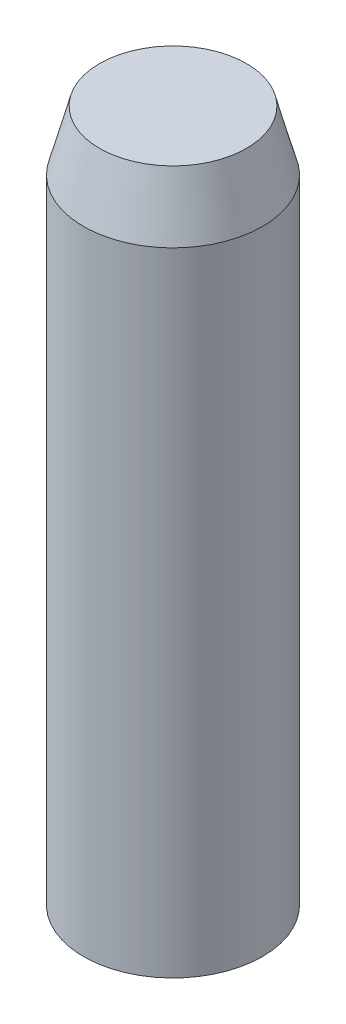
from build123d import *


with BuildPart() as part:
    # Esquisse3 → Base-R_volution (revolve)
    with BuildSketch(Plane.XY, mode=Mode.PRIVATE) as base_r_volution_sk:
        with BuildLine():
            Line((0, 16), (0, 0))
            ThreePointArc((0, 0), (1.03527618, 0.136296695), (2, 0.535898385))
            Line((2, 0.535898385), (2, 14.666666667))
            Line((2, 14.666666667), (1.64273441, 16))
            Line((1.64273441, 16), (0, 16))
        make_face()
    revolve(base_r_volution_sk.sketch.rotate(Axis((0, 16, 0), (0, -1, 0)), 180), axis=Axis((0, 16, 0), (0, -1, 0)))


solid = part.part
